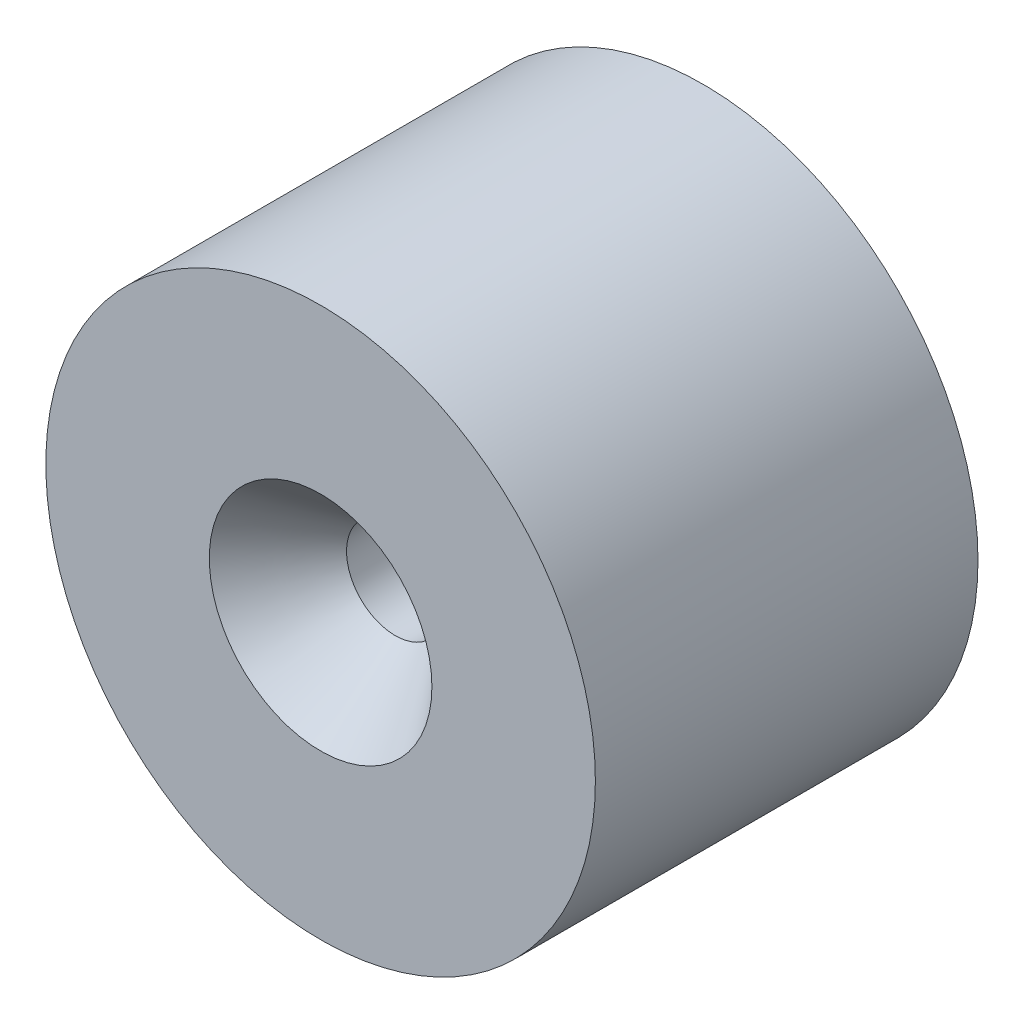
from build123d import *

# Parameters (mm, degrees)
SKETCH1_R                                       = 7.9
SKETCH1_R_2                                     = 1.4
EXTRUDE_THIN1_DEPTH                             = 11
SKETCH4_R                                       = 5.3
SKETCH4_R_2                                     = 3.5
CUT_EXTRUDE1_DEPTH                              = 7
CSK_FOR_M3_FLAT_HEAD_MACHINE_SCREW1_D           = 2.8
CSK_FOR_M3_FLAT_HEAD_MACHINE_SCREW1_DEPTH       = 14
CSK_FOR_M3_FLAT_HEAD_MACHINE_SCREW1_CSINK_D     = 6.4
CSK_FOR_M3_FLAT_HEAD_MACHINE_SCREW1_CSINK_ANGLE = 80
CSK_FOR_M3_FLAT_HEAD_MACHINE_SCREW1_TIP         = 0.841204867


with BuildPart() as part:
    # Sketch1 → Extrude-Thin1 (new body)
    with BuildSketch(Plane.XY):
        Circle(SKETCH1_R)
        Circle(SKETCH1_R_2, mode=Mode.SUBTRACT)
    extrude(amount=EXTRUDE_THIN1_DEPTH)

    # Sketch4 → Cut-Extrude1 (cut)
    with BuildSketch(Plane(origin=(0, 0, 2), x_dir=(-1, 0, 0), z_dir=(0, 0, -1))):
        Circle(SKETCH4_R)
        Circle(SKETCH4_R_2, mode=Mode.SUBTRACT)
    extrude(amount=-CUT_EXTRUDE1_DEPTH, mode=Mode.SUBTRACT)

    # CSK for M3 Flat Head Machine Screw1
    with Locations(Plane.XY.offset(11)):
        with Locations((0, 0)):
            CounterSinkHole(CSK_FOR_M3_FLAT_HEAD_MACHINE_SCREW1_D / 2, CSK_FOR_M3_FLAT_HEAD_MACHINE_SCREW1_CSINK_D / 2, depth=CSK_FOR_M3_FLAT_HEAD_MACHINE_SCREW1_DEPTH, counter_sink_angle=CSK_FOR_M3_FLAT_HEAD_MACHINE_SCREW1_CSINK_ANGLE)
            with Locations((0, 0, -(CSK_FOR_M3_FLAT_HEAD_MACHINE_SCREW1_DEPTH + CSK_FOR_M3_FLAT_HEAD_MACHINE_SCREW1_TIP / 2))):  # 118° drill point
                Cone(0, CSK_FOR_M3_FLAT_HEAD_MACHINE_SCREW1_D / 2, CSK_FOR_M3_FLAT_HEAD_MACHINE_SCREW1_TIP, mode=Mode.SUBTRACT)


solid = part.part
